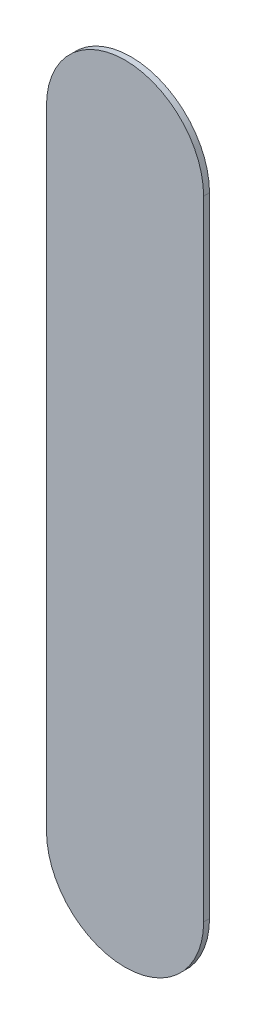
ISO-10303-21;
HEADER;
FILE_DESCRIPTION(('STEP AP214'),'2;1');
FILE_NAME('part.step','',(''),(''),'','','');
FILE_SCHEMA(('AUTOMOTIVE_DESIGN { 1 0 10303 214 1 1 1 1 }'));
ENDSEC;
DATA;
#1=APPLICATION_CONTEXT('core data for automotive mechanical design processes');
#2=APPLICATION_PROTOCOL_DEFINITION('international standard','automotive_design',2000,#1);
#3=PRODUCT_CONTEXT('',#1,'mechanical');
#4=PRODUCT('Part','Part','',(#3));
#5=PRODUCT_RELATED_PRODUCT_CATEGORY('part','',(#4));
#6=PRODUCT_DEFINITION_FORMATION('','',#4);
#7=PRODUCT_DEFINITION_CONTEXT('part definition',#1,'design');
#8=PRODUCT_DEFINITION('design','',#6,#7);
#9=PRODUCT_DEFINITION_SHAPE('','',#8);
#10=(LENGTH_UNIT() NAMED_UNIT(*) SI_UNIT(.MILLI.,.METRE.));
#11=(NAMED_UNIT(*) PLANE_ANGLE_UNIT() SI_UNIT($,.RADIAN.));
#12=(NAMED_UNIT(*) SI_UNIT($,.STERADIAN.) SOLID_ANGLE_UNIT());
#13=UNCERTAINTY_MEASURE_WITH_UNIT(LENGTH_MEASURE(1.E-05),#10,'distance_accuracy_value','');
#14=(GEOMETRIC_REPRESENTATION_CONTEXT(3) GLOBAL_UNCERTAINTY_ASSIGNED_CONTEXT((#13)) GLOBAL_UNIT_ASSIGNED_CONTEXT((#10,
#11,#12)) REPRESENTATION_CONTEXT('',''));
#15=CARTESIAN_POINT('',(0.,0.,0.));
#16=DIRECTION('',(0.,0.,1.));
#17=DIRECTION('',(1.,0.,0.));
#18=AXIS2_PLACEMENT_3D('',#15,#16,#17);
#19=CARTESIAN_POINT('',(0.,0.,3.));
#20=DIRECTION('',(0.,0.,-1.));
#21=DIRECTION('',(-1.,0.,0.));
#22=AXIS2_PLACEMENT_3D('',#19,#20,#21);
#23=CYLINDRICAL_SURFACE('',#22,40.);
#24=CARTESIAN_POINT('',(0.,0.,0.));
#25=DIRECTION('',(0.,0.,1.));
#26=DIRECTION('',(1.,0.,0.));
#27=AXIS2_PLACEMENT_3D('',#24,#25,#26);
#28=CIRCLE('',#27,40.);
#29=CARTESIAN_POINT('',(-40.,0.,0.));
#30=VERTEX_POINT('',#29);
#31=CARTESIAN_POINT('',(40.,0.,0.));
#32=VERTEX_POINT('',#31);
#33=EDGE_CURVE('E95',#30,#32,#28,.T.);
#34=ORIENTED_EDGE('',*,*,#33,.T.);
#35=DIRECTION('',(0.,0.,-1.));
#36=VECTOR('',#35,1.);
#37=CARTESIAN_POINT('',(40.,0.,3.));
#38=LINE('',#37,#36);
#39=CARTESIAN_POINT('',(40.,0.,3.));
#40=VERTEX_POINT('',#39);
#41=EDGE_CURVE('E11',#40,#32,#38,.T.);
#42=ORIENTED_EDGE('',*,*,#41,.F.);
#43=CARTESIAN_POINT('',(0.,0.,3.));
#44=DIRECTION('',(0.,0.,1.));
#45=DIRECTION('',(1.,0.,0.));
#46=AXIS2_PLACEMENT_3D('',#43,#44,#45);
#47=CIRCLE('',#46,40.);
#48=CARTESIAN_POINT('',(-40.,0.,3.));
#49=VERTEX_POINT('',#48);
#50=EDGE_CURVE('E83',#49,#40,#47,.T.);
#51=ORIENTED_EDGE('',*,*,#50,.F.);
#52=DIRECTION('',(0.,0.,-1.));
#53=VECTOR('',#52,1.);
#54=CARTESIAN_POINT('',(-40.,0.,3.));
#55=LINE('',#54,#53);
#56=EDGE_CURVE('E91',#49,#30,#55,.T.);
#57=ORIENTED_EDGE('',*,*,#56,.T.);
#58=EDGE_LOOP('',(#34,#42,#51,#57));
#59=FACE_BOUND('',#58,.T.);
#60=ADVANCED_FACE('F32',(#59),#23,.T.);
#61=CARTESIAN_POINT('',(40.,0.,3.));
#62=DIRECTION('',(-1.,0.,0.));
#63=DIRECTION('',(0.,0.,1.));
#64=AXIS2_PLACEMENT_3D('',#61,#62,#63);
#65=PLANE('',#64);
#66=DIRECTION('',(0.,1.,0.));
#67=VECTOR('',#66,1.);
#68=CARTESIAN_POINT('',(40.,0.,0.));
#69=LINE('',#68,#67);
#70=CARTESIAN_POINT('',(40.,320.,0.));
#71=VERTEX_POINT('',#70);
#72=EDGE_CURVE('E87',#32,#71,#69,.T.);
#73=ORIENTED_EDGE('',*,*,#72,.T.);
#74=DIRECTION('',(0.,0.,-1.));
#75=VECTOR('',#74,1.);
#76=CARTESIAN_POINT('',(40.,320.,3.));
#77=LINE('',#76,#75);
#78=CARTESIAN_POINT('',(40.,320.,3.));
#79=VERTEX_POINT('',#78);
#80=EDGE_CURVE('E40',#79,#71,#77,.T.);
#81=ORIENTED_EDGE('',*,*,#80,.F.);
#82=DIRECTION('',(0.,1.,0.));
#83=VECTOR('',#82,1.);
#84=CARTESIAN_POINT('',(40.,0.,3.));
#85=LINE('',#84,#83);
#86=EDGE_CURVE('E78',#40,#79,#85,.T.);
#87=ORIENTED_EDGE('',*,*,#86,.F.);
#88=ORIENTED_EDGE('',*,*,#41,.T.);
#89=EDGE_LOOP('',(#73,#81,#87,#88));
#90=FACE_BOUND('',#89,.T.);
#91=ADVANCED_FACE('F86',(#90),#65,.F.);
#92=CARTESIAN_POINT('',(0.,320.,3.));
#93=DIRECTION('',(0.,0.,-1.));
#94=DIRECTION('',(-1.,0.,0.));
#95=AXIS2_PLACEMENT_3D('',#92,#93,#94);
#96=CYLINDRICAL_SURFACE('',#95,40.);
#97=CARTESIAN_POINT('',(0.,320.,0.));
#98=DIRECTION('',(0.,0.,1.));
#99=DIRECTION('',(1.,0.,0.));
#100=AXIS2_PLACEMENT_3D('',#97,#98,#99);
#101=CIRCLE('',#100,40.);
#102=CARTESIAN_POINT('',(-40.,320.,0.));
#103=VERTEX_POINT('',#102);
#104=EDGE_CURVE('E65',#71,#103,#101,.T.);
#105=ORIENTED_EDGE('',*,*,#104,.T.);
#106=DIRECTION('',(0.,0.,-1.));
#107=VECTOR('',#106,1.);
#108=CARTESIAN_POINT('',(-40.,320.,3.));
#109=LINE('',#108,#107);
#110=CARTESIAN_POINT('',(-40.,320.,3.));
#111=VERTEX_POINT('',#110);
#112=EDGE_CURVE('E88',#111,#103,#109,.T.);
#113=ORIENTED_EDGE('',*,*,#112,.F.);
#114=CARTESIAN_POINT('',(0.,320.,3.));
#115=DIRECTION('',(0.,0.,1.));
#116=DIRECTION('',(1.,0.,0.));
#117=AXIS2_PLACEMENT_3D('',#114,#115,#116);
#118=CIRCLE('',#117,40.);
#119=EDGE_CURVE('E81',#79,#111,#118,.T.);
#120=ORIENTED_EDGE('',*,*,#119,.F.);
#121=ORIENTED_EDGE('',*,*,#80,.T.);
#122=EDGE_LOOP('',(#105,#113,#120,#121));
#123=FACE_BOUND('',#122,.T.);
#124=ADVANCED_FACE('F89',(#123),#96,.T.);
#125=CARTESIAN_POINT('',(-40.,0.,3.));
#126=DIRECTION('',(1.,0.,0.));
#127=DIRECTION('',(0.,0.,-1.));
#128=AXIS2_PLACEMENT_3D('',#125,#126,#127);
#129=PLANE('',#128);
#130=DIRECTION('',(0.,-1.,0.));
#131=VECTOR('',#130,1.);
#132=CARTESIAN_POINT('',(-40.,0.,0.));
#133=LINE('',#132,#131);
#134=EDGE_CURVE('E71',#103,#30,#133,.T.);
#135=ORIENTED_EDGE('',*,*,#134,.T.);
#136=ORIENTED_EDGE('',*,*,#56,.F.);
#137=DIRECTION('',(0.,-1.,0.));
#138=VECTOR('',#137,1.);
#139=CARTESIAN_POINT('',(-40.,0.,3.));
#140=LINE('',#139,#138);
#141=EDGE_CURVE('E48',#111,#49,#140,.T.);
#142=ORIENTED_EDGE('',*,*,#141,.F.);
#143=ORIENTED_EDGE('',*,*,#112,.T.);
#144=EDGE_LOOP('',(#135,#136,#142,#143));
#145=FACE_BOUND('',#144,.T.);
#146=ADVANCED_FACE('F102',(#145),#129,.F.);
#147=CARTESIAN_POINT('',(0.,0.,3.));
#148=DIRECTION('',(0.,0.,1.));
#149=DIRECTION('',(1.,0.,0.));
#150=AXIS2_PLACEMENT_3D('',#147,#148,#149);
#151=PLANE('',#150);
#152=ORIENTED_EDGE('',*,*,#50,.T.);
#153=ORIENTED_EDGE('',*,*,#86,.T.);
#154=ORIENTED_EDGE('',*,*,#119,.T.);
#155=ORIENTED_EDGE('',*,*,#141,.T.);
#156=EDGE_LOOP('',(#152,#153,#154,#155));
#157=FACE_BOUND('',#156,.T.);
#158=ADVANCED_FACE('F79',(#157),#151,.T.);
#159=CARTESIAN_POINT('',(0.,0.,0.));
#160=DIRECTION('',(0.,0.,1.));
#161=DIRECTION('',(1.,0.,0.));
#162=AXIS2_PLACEMENT_3D('',#159,#160,#161);
#163=PLANE('',#162);
#164=ORIENTED_EDGE('',*,*,#33,.F.);
#165=ORIENTED_EDGE('',*,*,#134,.F.);
#166=ORIENTED_EDGE('',*,*,#104,.F.);
#167=ORIENTED_EDGE('',*,*,#72,.F.);
#168=EDGE_LOOP('',(#164,#165,#166,#167));
#169=FACE_BOUND('',#168,.T.);
#170=ADVANCED_FACE('F105',(#169),#163,.F.);
#171=CLOSED_SHELL('',(#60,#91,#124,#146,#158,#170));
#172=MANIFOLD_SOLID_BREP('B2',#171);
#173=ADVANCED_BREP_SHAPE_REPRESENTATION('',(#18,#172),#14);
#174=SHAPE_DEFINITION_REPRESENTATION(#9,#173);
ENDSEC;
END-ISO-10303-21;
